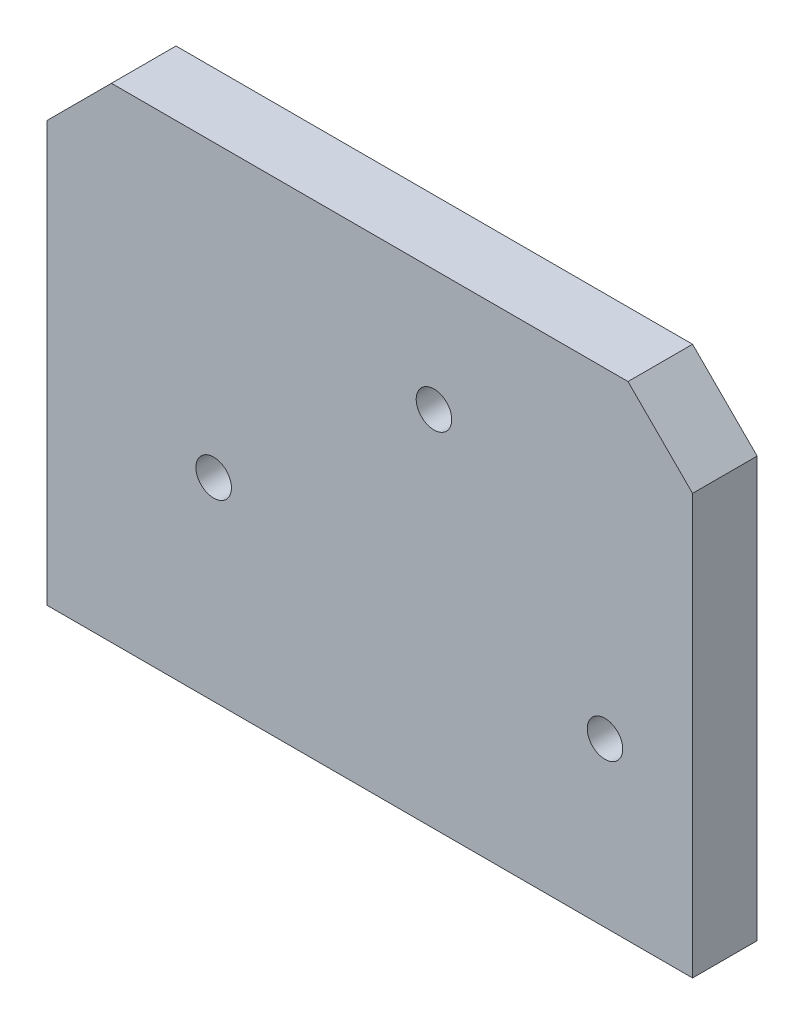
from build123d import *

# Parameters (mm, degrees)
SKIZZE1_W                 = 200
SKIZZE1_H                 = 150
LINEAR_AUSTRAGEN1_DEPTH   = 20
FASE1_SIZE                = 20
DURCHGANGSLOCH_F_R_M101_D = 11


with BuildPart() as part:
    # Skizze1 → Linear austragen1 (new body)
    with BuildSketch(Plane.XY):
        Rectangle(SKIZZE1_W, SKIZZE1_H)
    extrude(amount=LINEAR_AUSTRAGEN1_DEPTH)

    # Fase1
    fase1_edges = [part.edges().sort_by_distance(p)[0] for p in [
        (-100, 75, 10),
        (100, 75, 10),
    ]]
    chamfer(fase1_edges, length=FASE1_SIZE)

    # Durchgangsloch f_r M101 (through all)
    with Locations(Plane.XY.offset(40)):
        with Locations((-48.330756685, -14.940951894), (19.90302759, 37.463052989), (72.870582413, -24.400723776)):
            Hole(DURCHGANGSLOCH_F_R_M101_D / 2)


solid = part.part
